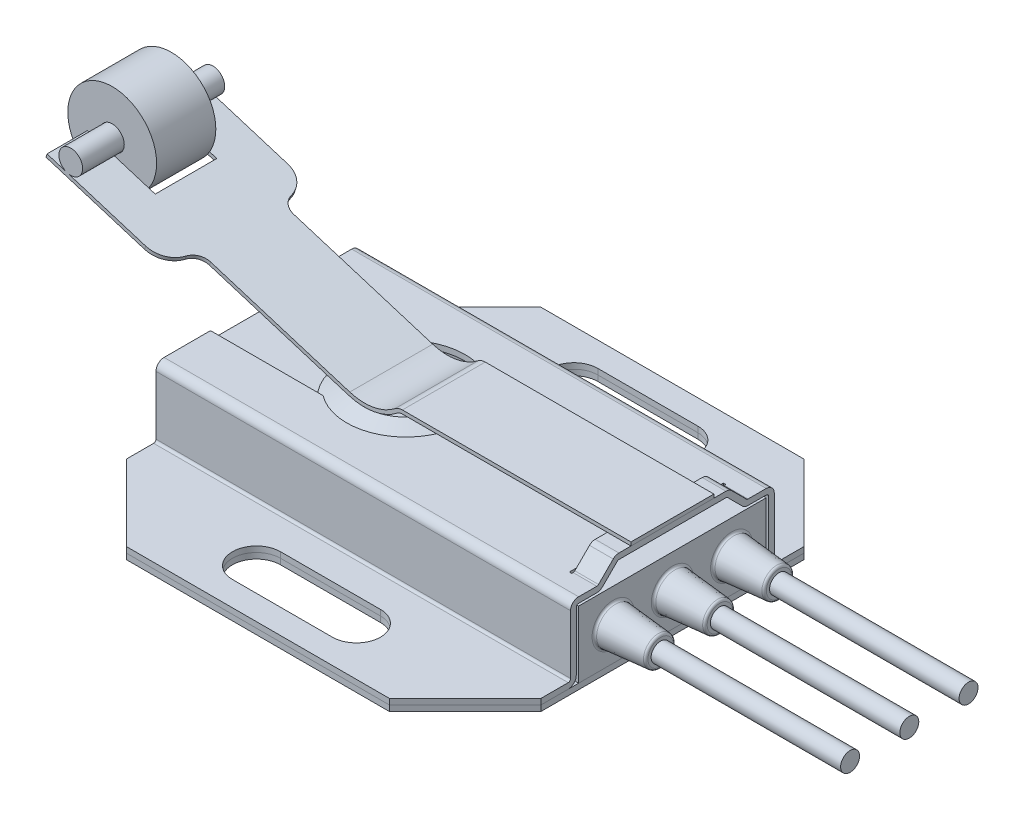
from build123d import *

# Parameters (mm, degrees)
SKETCH1_W                 = 44.45
SKETCH1_H                 = 44.45
EXTRUDE1_DEPTH            = 0.6096
EXTRUDE2_DEPTH            = 2.54
EXTRUDE14_DEPTH           = 44.45
SKETCH21_W                = 41.656
SKETCH21_H                = 16.51
EXTRUDE15_DEPTH           = 0.6096
FILLET2_R                 = 0.254
FILLET3_R                 = 0.8636
CUT_EXTRUDE3_DEPTH        = 35.404194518
EXTRUDE9_DEPTH            = 7.62
CUT_EXTRUDE4_DEPTH        = 47.829815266
CUT_EXTRUDE4_DEPTH_BACK   = 47.829815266
SKETCH13_W                = 7.62
SKETCH13_H                = 6.604
FILLET6_R                 = 2.54
EXTRUDE10_DEPTH           = 7.62
SKETCH15_R                = 4.7625
SKETCH15_R_2              = 1.2954
EXTRUDE11_DEPTH           = 3.175
SKETCH18_W                = 20.1168
SKETCH18_H                = 7.1628
EXTRUDE12_DEPTH           = 44.45
SKETCH19_R                = 1.016
EXTRUDE13_DEPTH           = 25.4
CUT_EXTRUDE5_DEPTH        = 0.6096
SKETCH23_R                = 2.032
EXTRUDE16_DEPTH           = 5.08
EXTRUDE16_DRAFT           = 5
EXTRUDE16_PROFILE_2_DEPTH = 5.08
EXTRUDE16_PROFILE_2_DRAFT = 5
EXTRUDE16_PROFILE_3_DEPTH = 5.08
EXTRUDE16_PROFILE_3_DRAFT = 5
FILLET7_R                 = 0.254


with BuildPart() as part:
    # Sketch1 → Extrude1 (new body)
    with BuildSketch(Plane(origin=(0, 0, 0), x_dir=(1, 0, 0), z_dir=(0, 1, 0))):
        Rectangle(SKETCH1_W, SKETCH1_H)
    extrude(amount=EXTRUDE1_DEPTH)


with BuildPart() as body_2:
    # Sketch2 → Extrude2 (new body)
    with BuildSketch(Plane.ZY.offset(-22.225)):
        Polygon((10.922, 8.636), (8.001, 8.636), (6.096, 10.541), (-6.096, 10.541), (-8.001, 8.636), (-10.922, 8.636), (-10.922, 8.0264), (-10.922, 1.2192), (-22.225, 1.2192), (-22.225, 0.6096), (-10.3124, 0.6096), (-10.3124, 8.0264), (-7.748495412, 8.0264), (-5.843495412, 9.9314), (5.843495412, 9.9314), (7.748495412, 8.0264), (10.3124, 8.0264), (10.3124, 0.6096), (22.225, 0.6096), (22.225, 1.2192), (10.922, 1.2192), align=None)
    extrude(amount=EXTRUDE2_DEPTH)

    # Sketch20 → Extrude14 (add)
    with BuildSketch(Plane(origin=(22.225, 0, 0), x_dir=(0, 0, -1), z_dir=(1, 0, 0))):
        Polygon((8.255, 8.636), (10.922, 8.636), (10.922, 1.2192), (22.225, 1.2192), (22.225, 0.6096), (10.3124, 0.6096), (10.3124, 8.0264), (8.255, 8.0264), align=None)
        Polygon((-10.922, 8.636), (-8.255, 8.636), (-8.255, 8.0264), (-10.3124, 8.0264), (-10.3124, 0.6096), (-22.225, 0.6096), (-22.225, 1.2192), (-10.922, 1.2192), align=None)
    extrude(amount=-EXTRUDE14_DEPTH)

    # Sketch21 → Extrude15 (add)
    with BuildSketch(Plane(origin=(0, 8.636, 0), x_dir=(-1, 0, 0), z_dir=(0, 1, 0))):
        with Locations((1.397, 0)):
            Rectangle(SKETCH21_W, SKETCH21_H)
    extrude(amount=-EXTRUDE15_DEPTH)

    # Fillet2
    fillet2_edges = [body_2.edges().sort_by_distance(p)[0] for p in [
        (0, 1.2192, 10.922),
        (0, 8.0264, 10.3124),
        (20.955, 9.9314, 5.843495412),
        (20.955, 9.9314, -5.843495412),
        (0, 8.0264, -10.3124),
        (0, 1.2192, -10.922),
        (20.955, 8.636, -8.001),
        (20.955, 8.636, 8.001),
    ]]
    fillet(fillet2_edges, radius=FILLET2_R)

    # Fillet3
    fillet3_edges = [body_2.edges().sort_by_distance(p)[0] for p in [
        (0, 0.6096, 10.3124),
        (20.955, 8.0264, 7.748495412),
        (20.955, 8.0264, -7.748495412),
        (0, 0.6096, -10.3124),
        (0, 8.636, -10.922),
        (20.955, 10.541, -6.096),
        (20.955, 10.541, 6.096),
        (0, 8.636, 10.922),
    ]]
    fillet(fillet3_edges, radius=FILLET3_R)


with BuildPart() as cut_extrude3_tool:
    # Sketch11 → Cut-Extrude3 (new, through all)
    with BuildSketch(Plane(origin=(-1.8288, 0, 0), x_dir=(0, 0, 1), z_dir=(0, 1, 0))):
        with BuildLine():
            Line((14.4399, -3.5306), (14.4399, 7.1882))
            ThreePointArc((14.4399, 7.1882), (17.018, 9.7663), (19.5961, 7.1882))
            Line((19.5961, 7.1882), (19.5961, -3.5306))
            ThreePointArc((19.5961, -3.5306), (17.018, -6.1087), (14.4399, -3.5306))
        make_face()
        with BuildLine():
            Line((-19.5961, 7.1882), (-19.5961, -3.5306))
            ThreePointArc((-19.5961, -3.5306), (-17.018, -6.1087), (-14.4399, -3.5306))
            Line((-14.4399, -3.5306), (-14.4399, 7.1882))
            ThreePointArc((-14.4399, 7.1882), (-17.018, 9.7663), (-19.5961, 7.1882))
        make_face()
        Polygon((-22.225, 24.0538), (-14.097, 24.0538), (-22.225, 15.9258), align=None)
        Polygon((22.225, -20.3962), (22.225, -12.2682), (14.097, -20.3962), align=None)
        Polygon((-22.225, -20.3962), (-14.097, -20.3962), (-22.225, -12.2682), align=None)
        Polygon((14.097, 24.0538), (22.225, 15.9258), (22.225, 24.0538), align=None)
    extrude(amount=CUT_EXTRUDE3_DEPTH)


with BuildPart() as part_1:
    add(part.part)

    # Cut-Extrude3: cut by cut_extrude3_tool
    add(cut_extrude3_tool.part, mode=Mode.SUBTRACT)


with BuildPart() as body_2_1:
    add(body_2.part)

    # Cut-Extrude3: cut by cut_extrude3_tool
    add(cut_extrude3_tool.part, mode=Mode.SUBTRACT)

    # Sketch22 → Cut-Extrude5 (cut)
    with BuildSketch(Plane(origin=(0, 8.636, 0), x_dir=(-1, 0, 0), z_dir=(0, 1, 0))):
        with BuildLine():
            Line((10.16, -5.08), (22.225, -5.08))
            Line((22.225, -5.08), (22.225, 5.08))
            Line((22.225, 5.08), (10.16, 5.08))
            ThreePointArc((10.16, 5.08), (0, 0), (10.16, -5.08))
        make_face()
    extrude(amount=-CUT_EXTRUDE5_DEPTH, mode=Mode.SUBTRACT)


with BuildPart() as body_3:
    # Sketch12 → Extrude9 (new, symmetric)
    with BuildSketch(Plane.XY):
        with BuildLine():
            Line((22.225, 10.541), (-2.28798486, 10.541))
            ThreePointArc((-2.28798486, 10.541), (-2.577107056, 10.492671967), (-2.83479459, 10.352942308))
            ThreePointArc((-2.83479459, 10.352942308), (-5.320008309, 9.237581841), (-8.039226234, 9.399353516))
            Line((-8.039226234, 9.399353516), (-37.323615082, 18.460005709))
            Line((-37.323615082, 18.460005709), (-37.211, 18.823982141))
            Line((-37.211, 18.823982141), (-7.926611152, 9.763329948))
            ThreePointArc((-7.926611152, 9.763329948), (-5.388674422, 9.612343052), (-3.069141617, 10.653346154))
            ThreePointArc((-3.069141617, 10.653346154), (-2.701016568, 10.852959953), (-2.28798486, 10.922))
            Line((-2.28798486, 10.922), (22.225, 10.922))
            Line((22.225, 10.922), (22.225, 10.541))
        make_face()
    extrude(amount=EXTRUDE9_DEPTH, both=True)

    # Sketch13 → Cut-Extrude4 (cut, two sides: drawn at the far end of the back side and taken through both)
    with BuildSketch(Plane(origin=(2.06436239, 6.672101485, 0), x_dir=(-0.9553187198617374, 0.2955776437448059, 0), z_dir=(0.29557764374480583, 0.9553187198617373, 0)).offset(-CUT_EXTRUDE4_DEPTH_BACK)):
        with Locations((37.302313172, 0)):
            Rectangle(SKETCH13_W, SKETCH13_H)
        with BuildLine():
            Line((27.603725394, 7.62), (27.603725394, 5.969))
            ThreePointArc((27.603725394, 5.969), (27.157356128, 4.891369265), (26.079725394, 4.445))
            Line((26.079725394, 4.445), (-18.116274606, 4.445))
            Line((-18.116274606, 4.445), (-18.116274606, 7.62))
            Line((-18.116274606, 7.62), (27.603725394, 7.62))
        make_face()
        with BuildLine():
            Line((-18.116274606, -7.62), (27.603725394, -7.62))
            Line((27.603725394, -7.62), (27.603725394, -5.969))
            ThreePointArc((27.603725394, -5.969), (27.157356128, -4.891369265), (26.079725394, -4.445))
            Line((26.079725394, -4.445), (-18.116274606, -4.445))
            Line((-18.116274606, -4.445), (-18.116274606, -7.62))
        make_face()
    extrude(amount=CUT_EXTRUDE4_DEPTH + CUT_EXTRUDE4_DEPTH_BACK, mode=Mode.SUBTRACT)

    # Fillet6
    fillet6_edges = [body_3.edges().sort_by_distance(p)[0] for p in [
        (-24.362300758, 14.649157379, 7.62),
        (-24.362300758, 14.649157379, -7.62),
    ]]
    fillet(fillet6_edges, radius=FILLET6_R)

    # Sketch14 → Extrude10 (add, symmetric)
    with BuildSketch(Plane.XY):
        with BuildLine():
            Line((-35.275243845, 18.25045507), (-35.275243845, 18.22505507))
            Line((-35.275243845, 18.22505507), (-34.80317893, 18.078997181))
            Line((-34.80317893, 18.078997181), (-34.80317893, 18.104397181))
            ThreePointArc((-34.80317893, 18.104397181), (-34.295616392, 20.580754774), (-35.275243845, 18.25045507))
        make_face()
    extrude(amount=EXTRUDE10_DEPTH, both=True)


with BuildPart() as body_4:
    # Sketch15 → Extrude11 (new, symmetric)
    with BuildSketch(Plane.XY):
        with Locations((-34.671, 19.3675)):
            Circle(SKETCH15_R)
        with Locations((-34.671, 19.3675)):
            Circle(SKETCH15_R_2, mode=Mode.SUBTRACT)
    extrude(amount=EXTRUDE11_DEPTH, both=True)


with BuildPart() as body_5:
    # Sketch17 → Revolve1 (revolve)
    with BuildSketch(Plane.XY, mode=Mode.PRIVATE) as revolve1_sk:
        Polygon((-6.35, 9.144), (-10.795, 9.144), (-13.335, 7.62), (-6.35, 7.62), align=None)
    revolve(revolve1_sk.sketch.rotate(Axis((-6.35, 9.144, 0), (0, 1, 0)), 270), axis=Axis((-6.35, 9.144, 0), (0, 1, 0)))

    # Sketch18 → Extrude12 (add)
    with BuildSketch(Plane.ZY.offset(-22.225)):
        with Locations((0, 4.191)):
            Rectangle(SKETCH18_W, SKETCH18_H)
    extrude(amount=EXTRUDE12_DEPTH)

    # Sketch19 → Extrude13 (add)
    with BuildSketch(Plane.ZY.offset(-22.225)):
        with Locations((-6.35, 4.191)):
            Circle(SKETCH19_R)
        with Locations((0, 4.191)):
            Circle(SKETCH19_R)
        with Locations((6.35, 4.191)):
            Circle(SKETCH19_R)
    extrude(amount=-EXTRUDE13_DEPTH)


with BuildPart() as extrude16_tool:
    # Sketch23 → Extrude16 (with draft: the straight prism first)
    with BuildSketch(Plane(origin=(22.225, 0, 0), x_dir=(0, 0, -1), z_dir=(1, 0, 0))):
        with Locations((-6.35, 4.191)):
            Circle(SKETCH23_R)
    extrude(amount=EXTRUDE16_DEPTH)
    # Extrude16: the draft: its side faces are tilted about the plane it starts from
    extrude16_sides = [extrude16_tool.faces().sort_by_distance(p)[0] for p in [
        (24.765, 4.191, 8.382),
    ]]
    draft(extrude16_sides, Plane(origin=(22.225, 0, 0), x_dir=(0, 0, -1), z_dir=(1, 0, 0)), EXTRUDE16_DRAFT)


with BuildPart() as body_5_1:
    add(body_5.part)

    # Extrude16: add extrude16_tool
    add(extrude16_tool.part)


with BuildPart() as extrude16_profile_2_tool:
    # Sketch23 → Extrude16 profile 2 (with draft: the straight prism first)
    with BuildSketch(Plane(origin=(22.225, 0, 0), x_dir=(0, 0, -1), z_dir=(1, 0, 0))):
        with Locations((0, 4.191)):
            Circle(SKETCH23_R)
    extrude(amount=EXTRUDE16_PROFILE_2_DEPTH)
    # Extrude16 profile 2: the draft: its side faces are tilted about the plane it starts from
    extrude16_profile_2_sides = [extrude16_profile_2_tool.faces().sort_by_distance(p)[0] for p in [
        (24.765, 4.191, 2.032),
    ]]
    draft(extrude16_profile_2_sides, Plane(origin=(22.225, 0, 0), x_dir=(0, 0, -1), z_dir=(1, 0, 0)), EXTRUDE16_PROFILE_2_DRAFT)


with BuildPart() as body_5_2:
    add(body_5_1.part)

    # Extrude16 profile 2: add extrude16_profile_2_tool
    add(extrude16_profile_2_tool.part)


with BuildPart() as extrude16_profile_3_tool:
    # Sketch23 → Extrude16 profile 3 (with draft: the straight prism first)
    with BuildSketch(Plane(origin=(22.225, 0, 0), x_dir=(0, 0, -1), z_dir=(1, 0, 0))):
        with Locations((6.35, 4.191)):
            Circle(SKETCH23_R)
    extrude(amount=EXTRUDE16_PROFILE_3_DEPTH)
    # Extrude16 profile 3: the draft: its side faces are tilted about the plane it starts from
    extrude16_profile_3_sides = [extrude16_profile_3_tool.faces().sort_by_distance(p)[0] for p in [
        (24.765, 4.191, -4.318),
    ]]
    draft(extrude16_profile_3_sides, Plane(origin=(22.225, 0, 0), x_dir=(0, 0, -1), z_dir=(1, 0, 0)), EXTRUDE16_PROFILE_3_DRAFT)


with BuildPart() as body_5_3:
    add(body_5_2.part)

    # Extrude16 profile 3: add extrude16_profile_3_tool
    add(extrude16_profile_3_tool.part)

    # Fillet7
    fillet7_edges = [body_5_3.edges().sort_by_distance(p)[0] for p in [
        (22.225, 4.191, 8.382),
        (27.305, 4.191, 7.937557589),
        (22.225, 4.191, 2.032),
        (27.305, 4.191, 1.587557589),
        (22.225, 4.191, -4.318),
        (27.305, 4.191, -4.762442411),
    ]]
    fillet(fillet7_edges, radius=FILLET7_R)


solid = Compound([part_1.part, body_2_1.part, body_3.part, body_4.part, body_5_3.part])
